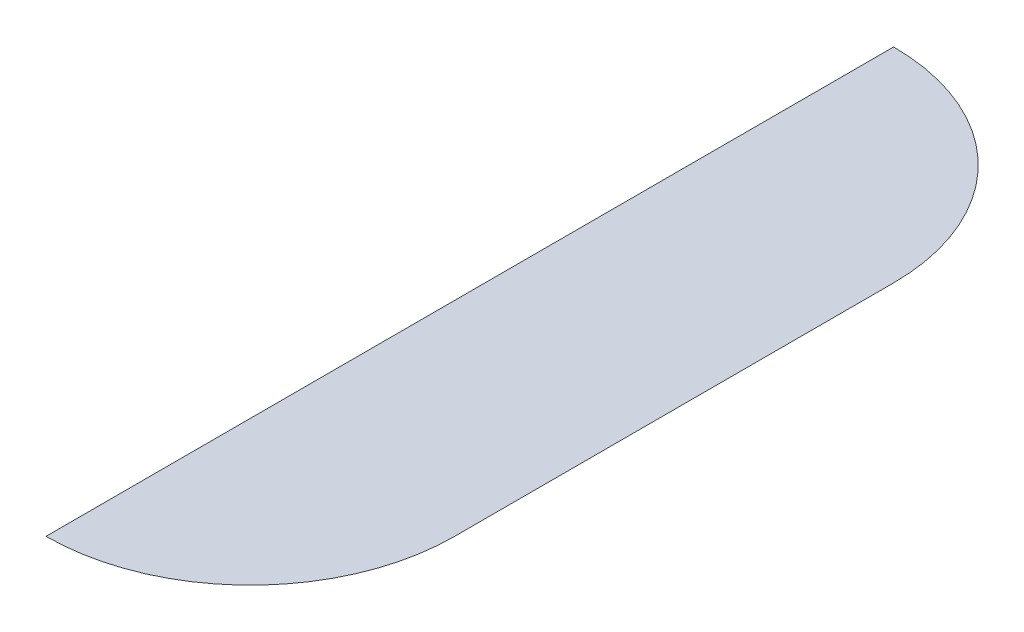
from build123d import *

# Parameters (mm, degrees)
SKETCH1_W           = 30
SKETCH1_H           = 3.464243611
BASE_EXTRUDE_DEPTH  = 38.1
BOSS_EXTRUDE1_DEPTH = 12.7
BOSS_REVOLVE2_ANGLE = 90
BOSS_REVOLVE3_ANGLE = 90
FILLET1_R           = 2.0701
SKETCH8_W           = 76.2
SKETCH8_H           = 3.464243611
CUT_EXTRUDE4_DEPTH  = 49.732948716


with BuildPart() as part:
    # Sketch1 → Base-Extrude (new, symmetric)
    with BuildSketch(Plane.XY):
        with Locations((0, 1.732121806)):
            Rectangle(SKETCH1_W, SKETCH1_H)
    extrude(amount=BASE_EXTRUDE_DEPTH, both=True)

    # Louver Body → Boss-Extrude1 (add, symmetric)
    with BuildSketch(Plane.XY):
        with BuildLine():
            Line((-5.4737, 0), (-5.4737, -4.826))
            ThreePointArc((-5.4737, -4.826), (0.508269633, -3.565969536), (5.4737, 0))
            Line((5.4737, 0), (-5.4737, 0))
        make_face()
    extrude(amount=BOSS_EXTRUDE1_DEPTH, both=True)

    # Sketch12 → Boss-Revolve2 (revolve)
    with BuildSketch(Plane.XY.offset(12.7)):
        with BuildLine():
            Line((5.4737, 0), (-5.4737, 0))
            Line((-5.4737, 0), (-5.4737, -4.826))
            ThreePointArc((-5.4737, -4.826), (0.508269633, -3.565969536), (5.4737, 0))
        make_face()
    revolve(axis=Axis((-5.4737, 0, 12.7), (0, -1, 0)), revolution_arc=BOSS_REVOLVE2_ANGLE)

    # Sketch13 → Boss-Revolve3 (revolve)
    with BuildSketch(Plane(origin=(0, 0, -12.7), x_dir=(-1, 0, 0), z_dir=(0, 0, -1))):
        with BuildLine():
            Line((5.4737, 0), (-5.4737, 0))
            ThreePointArc((-5.4737, 0), (-0.508269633, -3.565969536), (5.4737, -4.826))
            Line((5.4737, -4.826), (5.4737, 0))
        make_face()
    revolve(axis=Axis((-5.4737, -4.826, -12.7), (0, 1, 0)), revolution_arc=BOSS_REVOLVE3_ANGLE)

    # Fillet1
    fillet1_edges = [part.edges().sort_by_distance(p)[0] for p in [
        (5.4737, 0, 0),
        (2.267280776, 0, 20.440980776),
        (2.267280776, 0, -20.440980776),
    ]]
    fillet(fillet1_edges, radius=FILLET1_R)

    # Sketch8 → Cut-Extrude4 (cut, through all)
    with BuildSketch(Plane.ZY.offset(15)):
        with Locations((0, 1.732121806)):
            Rectangle(SKETCH8_W, SKETCH8_H)
    extrude(amount=-CUT_EXTRUDE4_DEPTH, mode=Mode.SUBTRACT)


solid = part.part
